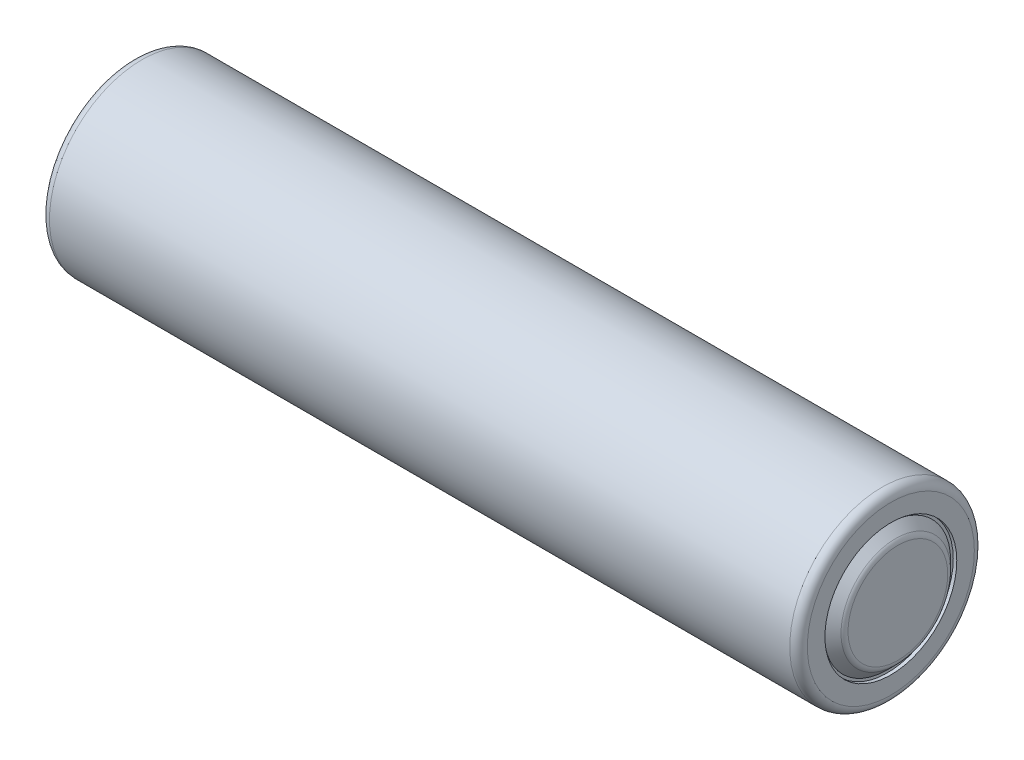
from build123d import *


with BuildPart() as part:
    # Esquisse1 → R_volution1 (revolve)
    with BuildSketch(Plane.XY, mode=Mode.PRIVATE) as r_volution1_sk:
        with BuildLine():
            Line((0, 0), (0, 0.883974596))
            ThreePointArc((0, 0.883974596), (0.066987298, 1.133974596), (0.25, 1.316987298))
            Line((0.25, 1.316987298), (0.75, 1.605662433))
            ThreePointArc((0.75, 1.605662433), (0.933012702, 1.788675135), (1, 2.038675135))
            Line((1, 2.038675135), (1, 2.711324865))
            ThreePointArc((1, 2.711324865), (1.066987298, 2.961324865), (1.25, 3.144337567))
            Line((1.25, 3.144337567), (1.5, 3.288675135))
            Line((1.5, 3.288675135), (1.5, 4))
            Line((1.5, 4), (1, 4))
            Line((1, 4), (1, 4.75))
            ThreePointArc((1, 4.75), (1.146446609, 5.103553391), (1.5, 5.25))
            Line((1.5, 5.25), (43.6, 5.25))
            ThreePointArc((43.6, 5.25), (43.953553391, 5.103553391), (44.1, 4.75))
            Line((44.1, 4.75), (44.1, 3.75))
            Line((44.1, 3.75), (43.9, 3.75))
            Line((43.9, 3.75), (43.9, 3.6))
            Line((43.9, 3.6), (44.382842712, 3.117157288))
            ThreePointArc((44.382842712, 3.117157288), (44.469551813, 2.987387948), (44.5, 2.834314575))
            Line((44.5, 2.834314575), (44.5, 0))
            Line((44.5, 0), (0, 0))
        make_face()
    revolve(r_volution1_sk.sketch.rotate(Axis((102.472385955, 0, 0), (-1, 0, 0)), 90), axis=Axis((102.472385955, 0, 0), (-1, 0, 0)))


solid = part.part
